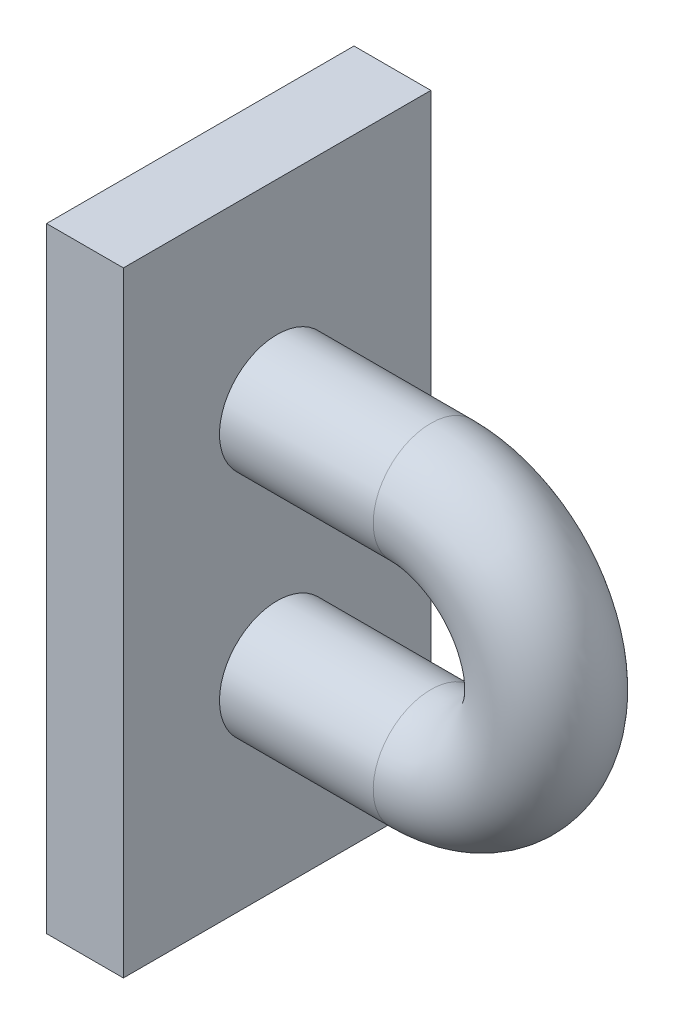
ISO-10303-21;
HEADER;
FILE_DESCRIPTION(('STEP AP214'),'2;1');
FILE_NAME('part.step','',(''),(''),'','','');
FILE_SCHEMA(('AUTOMOTIVE_DESIGN { 1 0 10303 214 1 1 1 1 }'));
ENDSEC;
DATA;
#1=APPLICATION_CONTEXT('core data for automotive mechanical design processes');
#2=APPLICATION_PROTOCOL_DEFINITION('international standard','automotive_design',2000,#1);
#3=PRODUCT_CONTEXT('',#1,'mechanical');
#4=PRODUCT('Part','Part','',(#3));
#5=PRODUCT_RELATED_PRODUCT_CATEGORY('part','',(#4));
#6=PRODUCT_DEFINITION_FORMATION('','',#4);
#7=PRODUCT_DEFINITION_CONTEXT('part definition',#1,'design');
#8=PRODUCT_DEFINITION('design','',#6,#7);
#9=PRODUCT_DEFINITION_SHAPE('','',#8);
#10=(LENGTH_UNIT() NAMED_UNIT(*) SI_UNIT(.MILLI.,.METRE.));
#11=(NAMED_UNIT(*) PLANE_ANGLE_UNIT() SI_UNIT($,.RADIAN.));
#12=(NAMED_UNIT(*) SI_UNIT($,.STERADIAN.) SOLID_ANGLE_UNIT());
#13=UNCERTAINTY_MEASURE_WITH_UNIT(LENGTH_MEASURE(1.E-05),#10,'distance_accuracy_value','');
#14=(GEOMETRIC_REPRESENTATION_CONTEXT(3) GLOBAL_UNCERTAINTY_ASSIGNED_CONTEXT((#13)) GLOBAL_UNIT_ASSIGNED_CONTEXT((#10,
#11,#12)) REPRESENTATION_CONTEXT('',''));
#15=CARTESIAN_POINT('',(0.,0.,0.));
#16=DIRECTION('',(0.,0.,1.));
#17=DIRECTION('',(1.,0.,0.));
#18=AXIS2_PLACEMENT_3D('',#15,#16,#17);
#19=CARTESIAN_POINT('',(-2.07863447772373E-13,15.0005,0.));
#20=DIRECTION('',(-1.,0.,0.));
#21=DIRECTION('',(0.,-1.,0.));
#22=AXIS2_PLACEMENT_3D('',#19,#20,#21);
#23=CYLINDRICAL_SURFACE('',#22,7.5);
#24=CARTESIAN_POINT('',(-2.07863447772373E-13,15.0005,0.));
#25=DIRECTION('',(-1.,0.,0.));
#26=DIRECTION('',(0.,0.,-1.));
#27=AXIS2_PLACEMENT_3D('',#24,#25,#26);
#28=CIRCLE('',#27,7.5);
#29=CARTESIAN_POINT('',(-3.11791707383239E-13,22.5005,0.));
#30=VERTEX_POINT('',#29);
#31=EDGE_CURVE('E40',#30,#30,#28,.T.);
#32=ORIENTED_EDGE('',*,*,#31,.T.);
#33=EDGE_LOOP('',(#32));
#34=FACE_BOUND('',#33,.T.);
#35=CARTESIAN_POINT('',(-20.0000000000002,15.0005,0.));
#36=DIRECTION('',(-1.,0.,0.));
#37=DIRECTION('',(0.,0.,-1.));
#38=AXIS2_PLACEMENT_3D('',#35,#36,#37);
#39=CIRCLE('',#38,7.5);
#40=CARTESIAN_POINT('',(-20.0000000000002,15.0005,-7.5));
#41=VERTEX_POINT('',#40);
#42=EDGE_CURVE('E11',#41,#41,#39,.T.);
#43=ORIENTED_EDGE('',*,*,#42,.F.);
#44=EDGE_LOOP('',(#43));
#45=FACE_BOUND('',#44,.T.);
#46=ADVANCED_FACE('F32',(#34,#45),#23,.T.);
#47=CARTESIAN_POINT('',(0.,0.,0.));
#48=DIRECTION('',(0.,0.,1.));
#49=DIRECTION('',(1.,0.,0.));
#50=AXIS2_PLACEMENT_3D('',#47,#48,#49);
#51=TOROIDAL_SURFACE('',#50,15.0005,7.5);
#52=CARTESIAN_POINT('',(0.,-15.0005,0.));
#53=DIRECTION('',(1.,0.,0.));
#54=DIRECTION('',(0.,0.,-1.));
#55=AXIS2_PLACEMENT_3D('',#52,#53,#54);
#56=CIRCLE('',#55,7.5);
#57=CARTESIAN_POINT('',(0.,-22.5005,0.));
#58=VERTEX_POINT('',#57);
#59=EDGE_CURVE('E113',#58,#58,#56,.T.);
#60=CARTESIAN_POINT('',(0.,0.,0.));
#61=DIRECTION('',(0.,0.,1.));
#62=DIRECTION('',(1.,0.,0.));
#63=AXIS2_PLACEMENT_3D('',#60,#61,#62);
#64=CIRCLE('',#63,22.5005);
#65=EDGE_CURVE('',#58,#30,#64,.T.);
#66=ORIENTED_EDGE('',*,*,#59,.T.);
#67=ORIENTED_EDGE('',*,*,#31,.F.);
#68=ORIENTED_EDGE('',*,*,#65,.T.);
#69=ORIENTED_EDGE('',*,*,#65,.F.);
#70=EDGE_LOOP('',(#66,#68,#67,#69));
#71=FACE_BOUND('',#70,.T.);
#72=ADVANCED_FACE('F120',(#71),#51,.T.);
#73=CARTESIAN_POINT('',(0.,-15.0005,0.));
#74=DIRECTION('',(-1.,0.,0.));
#75=DIRECTION('',(0.,-1.,0.));
#76=AXIS2_PLACEMENT_3D('',#73,#74,#75);
#77=CYLINDRICAL_SURFACE('',#76,7.5);
#78=ORIENTED_EDGE('',*,*,#59,.F.);
#79=EDGE_LOOP('',(#78));
#80=FACE_BOUND('',#79,.T.);
#81=CARTESIAN_POINT('',(-20.,-15.0005,0.));
#82=DIRECTION('',(-1.,0.,0.));
#83=DIRECTION('',(0.,0.,1.));
#84=AXIS2_PLACEMENT_3D('',#81,#82,#83);
#85=CIRCLE('',#84,7.5);
#86=CARTESIAN_POINT('',(-20.,-15.0005,7.5));
#87=VERTEX_POINT('',#86);
#88=EDGE_CURVE('E108',#87,#87,#85,.T.);
#89=ORIENTED_EDGE('',*,*,#88,.F.);
#90=EDGE_LOOP('',(#89));
#91=FACE_BOUND('',#90,.T.);
#92=ADVANCED_FACE('F122',(#80,#91),#77,.T.);
#93=CARTESIAN_POINT('',(-20.,-40.,-20.));
#94=DIRECTION('',(-1.,0.,0.));
#95=DIRECTION('',(0.,0.,1.));
#96=AXIS2_PLACEMENT_3D('',#93,#94,#95);
#97=PLANE('',#96);
#98=ORIENTED_EDGE('',*,*,#42,.T.);
#99=EDGE_LOOP('',(#98));
#100=FACE_BOUND('',#99,.T.);
#101=DIRECTION('',(0.,1.,0.));
#102=VECTOR('',#101,1.);
#103=CARTESIAN_POINT('',(-20.,40.,-20.));
#104=LINE('',#103,#102);
#105=CARTESIAN_POINT('',(-20.,-40.,-20.));
#106=VERTEX_POINT('',#105);
#107=CARTESIAN_POINT('',(-20.,40.,-20.));
#108=VERTEX_POINT('',#107);
#109=EDGE_CURVE('E99',#106,#108,#104,.T.);
#110=ORIENTED_EDGE('',*,*,#109,.T.);
#111=DIRECTION('',(0.,0.,1.));
#112=VECTOR('',#111,1.);
#113=CARTESIAN_POINT('',(-20.,40.,-20.));
#114=LINE('',#113,#112);
#115=CARTESIAN_POINT('',(-20.,40.,20.));
#116=VERTEX_POINT('',#115);
#117=EDGE_CURVE('E102',#108,#116,#114,.T.);
#118=ORIENTED_EDGE('',*,*,#117,.T.);
#119=DIRECTION('',(0.,-1.,0.));
#120=VECTOR('',#119,1.);
#121=CARTESIAN_POINT('',(-20.,40.,20.));
#122=LINE('',#121,#120);
#123=CARTESIAN_POINT('',(-20.,-40.,20.));
#124=VERTEX_POINT('',#123);
#125=EDGE_CURVE('E84',#116,#124,#122,.T.);
#126=ORIENTED_EDGE('',*,*,#125,.T.);
#127=DIRECTION('',(0.,0.,-1.));
#128=VECTOR('',#127,1.);
#129=CARTESIAN_POINT('',(-20.,-40.,-20.));
#130=LINE('',#129,#128);
#131=EDGE_CURVE('E95',#124,#106,#130,.T.);
#132=ORIENTED_EDGE('',*,*,#131,.T.);
#133=EDGE_LOOP('',(#110,#118,#126,#132));
#134=FACE_BOUND('',#133,.T.);
#135=ORIENTED_EDGE('',*,*,#88,.T.);
#136=EDGE_LOOP('',(#135));
#137=FACE_BOUND('',#136,.T.);
#138=ADVANCED_FACE('F128',(#100,#134,#137),#97,.F.);
#139=CARTESIAN_POINT('',(-30.,40.,-20.));
#140=DIRECTION('',(0.,0.,-1.));
#141=DIRECTION('',(-1.,0.,0.));
#142=AXIS2_PLACEMENT_3D('',#139,#140,#141);
#143=PLANE('',#142);
#144=ORIENTED_EDGE('',*,*,#109,.F.);
#145=DIRECTION('',(1.,0.,0.));
#146=VECTOR('',#145,1.);
#147=CARTESIAN_POINT('',(-30.,-40.,-20.));
#148=LINE('',#147,#146);
#149=CARTESIAN_POINT('',(-30.,-40.,-20.));
#150=VERTEX_POINT('',#149);
#151=EDGE_CURVE('E48',#150,#106,#148,.T.);
#152=ORIENTED_EDGE('',*,*,#151,.F.);
#153=DIRECTION('',(0.,1.,0.));
#154=VECTOR('',#153,1.);
#155=CARTESIAN_POINT('',(-30.,40.,-20.));
#156=LINE('',#155,#154);
#157=CARTESIAN_POINT('',(-30.,40.,-20.));
#158=VERTEX_POINT('',#157);
#159=EDGE_CURVE('E93',#150,#158,#156,.T.);
#160=ORIENTED_EDGE('',*,*,#159,.T.);
#161=DIRECTION('',(1.,0.,0.));
#162=VECTOR('',#161,1.);
#163=CARTESIAN_POINT('',(-30.,40.,-20.));
#164=LINE('',#163,#162);
#165=EDGE_CURVE('E76',#158,#108,#164,.T.);
#166=ORIENTED_EDGE('',*,*,#165,.T.);
#167=EDGE_LOOP('',(#144,#152,#160,#166));
#168=FACE_BOUND('',#167,.T.);
#169=ADVANCED_FACE('F132',(#168),#143,.T.);
#170=CARTESIAN_POINT('',(-30.,-40.,-20.));
#171=DIRECTION('',(0.,-1.,0.));
#172=DIRECTION('',(0.,0.,-1.));
#173=AXIS2_PLACEMENT_3D('',#170,#171,#172);
#174=PLANE('',#173);
#175=ORIENTED_EDGE('',*,*,#131,.F.);
#176=DIRECTION('',(1.,0.,0.));
#177=VECTOR('',#176,1.);
#178=CARTESIAN_POINT('',(-30.,-40.,20.));
#179=LINE('',#178,#177);
#180=CARTESIAN_POINT('',(-30.,-40.,20.));
#181=VERTEX_POINT('',#180);
#182=EDGE_CURVE('E65',#181,#124,#179,.T.);
#183=ORIENTED_EDGE('',*,*,#182,.F.);
#184=DIRECTION('',(0.,0.,-1.));
#185=VECTOR('',#184,1.);
#186=CARTESIAN_POINT('',(-30.,-40.,-20.));
#187=LINE('',#186,#185);
#188=EDGE_CURVE('E90',#181,#150,#187,.T.);
#189=ORIENTED_EDGE('',*,*,#188,.T.);
#190=ORIENTED_EDGE('',*,*,#151,.T.);
#191=EDGE_LOOP('',(#175,#183,#189,#190));
#192=FACE_BOUND('',#191,.T.);
#193=ADVANCED_FACE('F135',(#192),#174,.T.);
#194=CARTESIAN_POINT('',(-30.,40.,20.));
#195=DIRECTION('',(0.,0.,1.));
#196=DIRECTION('',(1.,0.,0.));
#197=AXIS2_PLACEMENT_3D('',#194,#195,#196);
#198=PLANE('',#197);
#199=ORIENTED_EDGE('',*,*,#125,.F.);
#200=DIRECTION('',(1.,0.,0.));
#201=VECTOR('',#200,1.);
#202=CARTESIAN_POINT('',(-30.,40.,20.));
#203=LINE('',#202,#201);
#204=CARTESIAN_POINT('',(-30.,40.,20.));
#205=VERTEX_POINT('',#204);
#206=EDGE_CURVE('E79',#205,#116,#203,.T.);
#207=ORIENTED_EDGE('',*,*,#206,.F.);
#208=DIRECTION('',(0.,-1.,0.));
#209=VECTOR('',#208,1.);
#210=CARTESIAN_POINT('',(-30.,40.,20.));
#211=LINE('',#210,#209);
#212=EDGE_CURVE('E82',#205,#181,#211,.T.);
#213=ORIENTED_EDGE('',*,*,#212,.T.);
#214=ORIENTED_EDGE('',*,*,#182,.T.);
#215=EDGE_LOOP('',(#199,#207,#213,#214));
#216=FACE_BOUND('',#215,.T.);
#217=ADVANCED_FACE('F81',(#216),#198,.T.);
#218=CARTESIAN_POINT('',(-30.,40.,-20.));
#219=DIRECTION('',(0.,1.,0.));
#220=DIRECTION('',(0.,0.,1.));
#221=AXIS2_PLACEMENT_3D('',#218,#219,#220);
#222=PLANE('',#221);
#223=ORIENTED_EDGE('',*,*,#117,.F.);
#224=ORIENTED_EDGE('',*,*,#165,.F.);
#225=DIRECTION('',(0.,0.,1.));
#226=VECTOR('',#225,1.);
#227=CARTESIAN_POINT('',(-30.,40.,-20.));
#228=LINE('',#227,#226);
#229=EDGE_CURVE('E89',#158,#205,#228,.T.);
#230=ORIENTED_EDGE('',*,*,#229,.T.);
#231=ORIENTED_EDGE('',*,*,#206,.T.);
#232=EDGE_LOOP('',(#223,#224,#230,#231));
#233=FACE_BOUND('',#232,.T.);
#234=ADVANCED_FACE('F92',(#233),#222,.T.);
#235=CARTESIAN_POINT('',(-30.,-40.,-20.));
#236=DIRECTION('',(-1.,0.,0.));
#237=DIRECTION('',(0.,0.,1.));
#238=AXIS2_PLACEMENT_3D('',#235,#236,#237);
#239=PLANE('',#238);
#240=ORIENTED_EDGE('',*,*,#159,.F.);
#241=ORIENTED_EDGE('',*,*,#188,.F.);
#242=ORIENTED_EDGE('',*,*,#212,.F.);
#243=ORIENTED_EDGE('',*,*,#229,.F.);
#244=EDGE_LOOP('',(#240,#241,#242,#243));
#245=FACE_BOUND('',#244,.T.);
#246=ADVANCED_FACE('F88',(#245),#239,.T.);
#247=CLOSED_SHELL('',(#46,#72,#92,#138,#169,#193,#217,#234,#246));
#248=MANIFOLD_SOLID_BREP('B2',#247);
#249=ADVANCED_BREP_SHAPE_REPRESENTATION('',(#18,#248),#14);
#250=SHAPE_DEFINITION_REPRESENTATION(#9,#249);
ENDSEC;
END-ISO-10303-21;
